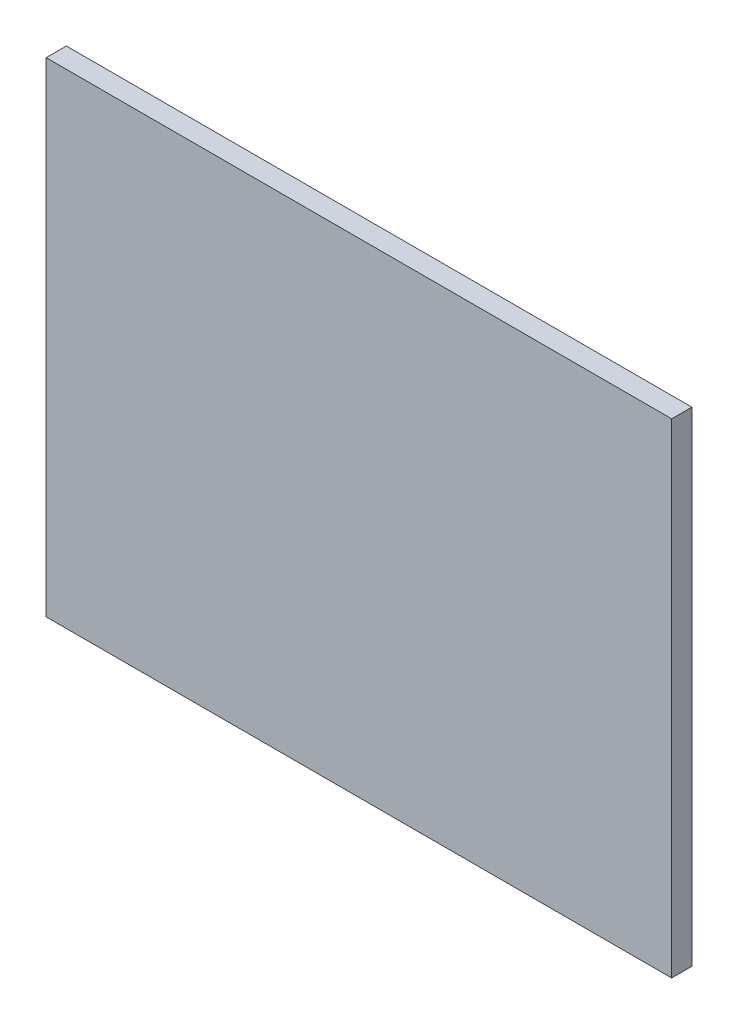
ISO-10303-21;
HEADER;
FILE_DESCRIPTION(('STEP AP214'),'2;1');
FILE_NAME('part.step','',(''),(''),'','','');
FILE_SCHEMA(('AUTOMOTIVE_DESIGN { 1 0 10303 214 1 1 1 1 }'));
ENDSEC;
DATA;
#1=APPLICATION_CONTEXT('core data for automotive mechanical design processes');
#2=APPLICATION_PROTOCOL_DEFINITION('international standard','automotive_design',2000,#1);
#3=PRODUCT_CONTEXT('',#1,'mechanical');
#4=PRODUCT('Part','Part','',(#3));
#5=PRODUCT_RELATED_PRODUCT_CATEGORY('part','',(#4));
#6=PRODUCT_DEFINITION_FORMATION('','',#4);
#7=PRODUCT_DEFINITION_CONTEXT('part definition',#1,'design');
#8=PRODUCT_DEFINITION('design','',#6,#7);
#9=PRODUCT_DEFINITION_SHAPE('','',#8);
#10=(LENGTH_UNIT() NAMED_UNIT(*) SI_UNIT(.MILLI.,.METRE.));
#11=(NAMED_UNIT(*) PLANE_ANGLE_UNIT() SI_UNIT($,.RADIAN.));
#12=(NAMED_UNIT(*) SI_UNIT($,.STERADIAN.) SOLID_ANGLE_UNIT());
#13=UNCERTAINTY_MEASURE_WITH_UNIT(LENGTH_MEASURE(1.E-05),#10,'distance_accuracy_value','');
#14=(GEOMETRIC_REPRESENTATION_CONTEXT(3) GLOBAL_UNCERTAINTY_ASSIGNED_CONTEXT((#13)) GLOBAL_UNIT_ASSIGNED_CONTEXT((#10,
#11,#12)) REPRESENTATION_CONTEXT('',''));
#15=CARTESIAN_POINT('',(0.,0.,0.));
#16=DIRECTION('',(0.,0.,1.));
#17=DIRECTION('',(1.,0.,0.));
#18=AXIS2_PLACEMENT_3D('',#15,#16,#17);
#19=CARTESIAN_POINT('',(0.,0.,0.0999998));
#20=DIRECTION('',(0.,0.,1.));
#21=DIRECTION('',(1.,0.,0.));
#22=AXIS2_PLACEMENT_3D('',#19,#20,#21);
#23=PLANE('',#22);
#24=DIRECTION('',(-1.,0.,0.));
#25=VECTOR('',#24,1.);
#26=CARTESIAN_POINT('',(1.54999944,1.20000014,0.0999998));
#27=LINE('',#26,#25);
#28=CARTESIAN_POINT('',(1.54999944,1.20000014,0.0999998));
#29=VERTEX_POINT('',#28);
#30=CARTESIAN_POINT('',(-1.54999944,1.20000014,0.0999998));
#31=VERTEX_POINT('',#30);
#32=EDGE_CURVE('E101',#29,#31,#27,.T.);
#33=ORIENTED_EDGE('',*,*,#32,.T.);
#34=DIRECTION('',(0.,-1.,0.));
#35=VECTOR('',#34,1.);
#36=CARTESIAN_POINT('',(-1.54999944,1.20000014,0.0999998));
#37=LINE('',#36,#35);
#38=CARTESIAN_POINT('',(-1.54999944,-1.20000014,0.0999998));
#39=VERTEX_POINT('',#38);
#40=EDGE_CURVE('E80',#31,#39,#37,.T.);
#41=ORIENTED_EDGE('',*,*,#40,.T.);
#42=DIRECTION('',(1.,0.,0.));
#43=VECTOR('',#42,1.);
#44=CARTESIAN_POINT('',(-1.54999944,-1.20000014,0.0999998));
#45=LINE('',#44,#43);
#46=CARTESIAN_POINT('',(1.54999944,-1.20000014,0.0999998));
#47=VERTEX_POINT('',#46);
#48=EDGE_CURVE('E85',#39,#47,#45,.T.);
#49=ORIENTED_EDGE('',*,*,#48,.T.);
#50=DIRECTION('',(0.,1.,0.));
#51=VECTOR('',#50,1.);
#52=CARTESIAN_POINT('',(1.54999944,-1.20000014,0.0999998));
#53=LINE('',#52,#51);
#54=EDGE_CURVE('E11',#47,#29,#53,.T.);
#55=ORIENTED_EDGE('',*,*,#54,.T.);
#56=EDGE_LOOP('',(#33,#41,#49,#55));
#57=FACE_BOUND('',#56,.T.);
#58=ADVANCED_FACE('F17',(#57),#23,.T.);
#59=CARTESIAN_POINT('',(0.,0.,0.));
#60=DIRECTION('',(0.,0.,1.));
#61=DIRECTION('',(1.,0.,0.));
#62=AXIS2_PLACEMENT_3D('',#59,#60,#61);
#63=PLANE('',#62);
#64=DIRECTION('',(0.,1.,0.));
#65=VECTOR('',#64,1.);
#66=CARTESIAN_POINT('',(1.54999944,-1.20000014,0.));
#67=LINE('',#66,#65);
#68=CARTESIAN_POINT('',(1.54999944,-1.20000014,0.));
#69=VERTEX_POINT('',#68);
#70=CARTESIAN_POINT('',(1.54999944,1.20000014,0.));
#71=VERTEX_POINT('',#70);
#72=EDGE_CURVE('E20',#69,#71,#67,.T.);
#73=ORIENTED_EDGE('',*,*,#72,.F.);
#74=DIRECTION('',(1.,0.,0.));
#75=VECTOR('',#74,1.);
#76=CARTESIAN_POINT('',(-1.54999944,-1.20000014,0.));
#77=LINE('',#76,#75);
#78=CARTESIAN_POINT('',(-1.54999944,-1.20000014,0.));
#79=VERTEX_POINT('',#78);
#80=EDGE_CURVE('E69',#79,#69,#77,.T.);
#81=ORIENTED_EDGE('',*,*,#80,.F.);
#82=DIRECTION('',(0.,-1.,0.));
#83=VECTOR('',#82,1.);
#84=CARTESIAN_POINT('',(-1.54999944,1.20000014,0.));
#85=LINE('',#84,#83);
#86=CARTESIAN_POINT('',(-1.54999944,1.20000014,0.));
#87=VERTEX_POINT('',#86);
#88=EDGE_CURVE('E74',#87,#79,#85,.T.);
#89=ORIENTED_EDGE('',*,*,#88,.F.);
#90=DIRECTION('',(-1.,0.,0.));
#91=VECTOR('',#90,1.);
#92=CARTESIAN_POINT('',(1.54999944,1.20000014,0.));
#93=LINE('',#92,#91);
#94=EDGE_CURVE('E118',#71,#87,#93,.T.);
#95=ORIENTED_EDGE('',*,*,#94,.F.);
#96=EDGE_LOOP('',(#73,#81,#89,#95));
#97=FACE_BOUND('',#96,.T.);
#98=ADVANCED_FACE('F71',(#97),#63,.F.);
#99=CARTESIAN_POINT('',(1.54999944,-1.20000014,0.));
#100=DIRECTION('',(-1.,0.,0.));
#101=DIRECTION('',(0.,0.,1.));
#102=AXIS2_PLACEMENT_3D('',#99,#100,#101);
#103=PLANE('',#102);
#104=ORIENTED_EDGE('',*,*,#72,.T.);
#105=DIRECTION('',(0.,0.,1.));
#106=VECTOR('',#105,1.);
#107=CARTESIAN_POINT('',(1.54999944,1.20000014,0.));
#108=LINE('',#107,#106);
#109=EDGE_CURVE('E95',#71,#29,#108,.T.);
#110=ORIENTED_EDGE('',*,*,#109,.T.);
#111=ORIENTED_EDGE('',*,*,#54,.F.);
#112=DIRECTION('',(0.,0.,1.));
#113=VECTOR('',#112,1.);
#114=CARTESIAN_POINT('',(1.54999944,-1.20000014,0.));
#115=LINE('',#114,#113);
#116=EDGE_CURVE('E79',#69,#47,#115,.T.);
#117=ORIENTED_EDGE('',*,*,#116,.F.);
#118=EDGE_LOOP('',(#104,#110,#111,#117));
#119=FACE_BOUND('',#118,.T.);
#120=ADVANCED_FACE('F126',(#119),#103,.F.);
#121=CARTESIAN_POINT('',(-1.54999944,-1.20000014,0.));
#122=DIRECTION('',(0.,1.,0.));
#123=DIRECTION('',(1.,0.,0.));
#124=AXIS2_PLACEMENT_3D('',#121,#122,#123);
#125=PLANE('',#124);
#126=ORIENTED_EDGE('',*,*,#80,.T.);
#127=ORIENTED_EDGE('',*,*,#116,.T.);
#128=ORIENTED_EDGE('',*,*,#48,.F.);
#129=DIRECTION('',(0.,0.,1.));
#130=VECTOR('',#129,1.);
#131=CARTESIAN_POINT('',(-1.54999944,-1.20000014,0.));
#132=LINE('',#131,#130);
#133=EDGE_CURVE('E83',#79,#39,#132,.T.);
#134=ORIENTED_EDGE('',*,*,#133,.F.);
#135=EDGE_LOOP('',(#126,#127,#128,#134));
#136=FACE_BOUND('',#135,.T.);
#137=ADVANCED_FACE('F84',(#136),#125,.F.);
#138=CARTESIAN_POINT('',(-1.54999944,1.20000014,0.));
#139=DIRECTION('',(1.,0.,0.));
#140=DIRECTION('',(0.,1.,0.));
#141=AXIS2_PLACEMENT_3D('',#138,#139,#140);
#142=PLANE('',#141);
#143=ORIENTED_EDGE('',*,*,#88,.T.);
#144=ORIENTED_EDGE('',*,*,#133,.T.);
#145=ORIENTED_EDGE('',*,*,#40,.F.);
#146=DIRECTION('',(0.,0.,1.));
#147=VECTOR('',#146,1.);
#148=CARTESIAN_POINT('',(-1.54999944,1.20000014,0.));
#149=LINE('',#148,#147);
#150=EDGE_CURVE('E92',#87,#31,#149,.T.);
#151=ORIENTED_EDGE('',*,*,#150,.F.);
#152=EDGE_LOOP('',(#143,#144,#145,#151));
#153=FACE_BOUND('',#152,.T.);
#154=ADVANCED_FACE('F90',(#153),#142,.F.);
#155=CARTESIAN_POINT('',(1.54999944,1.20000014,0.));
#156=DIRECTION('',(0.,-1.,0.));
#157=DIRECTION('',(0.,0.,-1.));
#158=AXIS2_PLACEMENT_3D('',#155,#156,#157);
#159=PLANE('',#158);
#160=ORIENTED_EDGE('',*,*,#94,.T.);
#161=ORIENTED_EDGE('',*,*,#150,.T.);
#162=ORIENTED_EDGE('',*,*,#32,.F.);
#163=ORIENTED_EDGE('',*,*,#109,.F.);
#164=EDGE_LOOP('',(#160,#161,#162,#163));
#165=FACE_BOUND('',#164,.T.);
#166=ADVANCED_FACE('F124',(#165),#159,.F.);
#167=CLOSED_SHELL('',(#58,#98,#120,#137,#154,#166));
#168=MANIFOLD_SOLID_BREP('B1',#167);
#169=ADVANCED_BREP_SHAPE_REPRESENTATION('',(#18,#168),#14);
#170=SHAPE_DEFINITION_REPRESENTATION(#9,#169);
ENDSEC;
END-ISO-10303-21;
